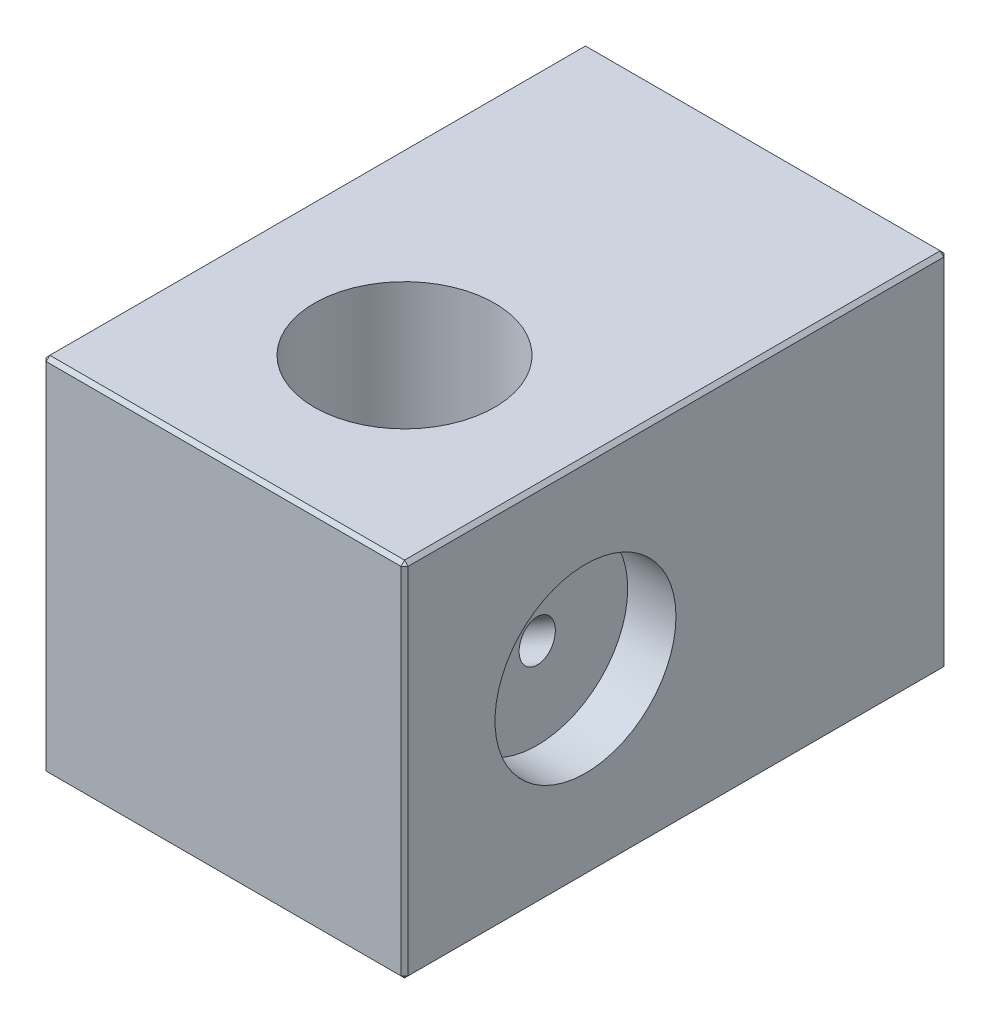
from build123d import *

# Parameters (mm, degrees)
SKICA1_W                      = 30
SKICA1_H                      = 45
P_IDAT_VYSUNUT_M1_DEPTH       = 30
ZKOSEN_1_SIZE                 = 0.3
SKICA2_R                      = 7.475
ODEBRAT_VYSUNUT_M1_DEPTH      = 12
SKICA3_R                      = 6.25
ODEBRAT_VYSUNUT_M2_DEPTH      = 3
F_3_5_3_5_PR_M_R_D_RY1_D      = 3.5
F_3_5_3_5_PR_M_R_D_RY1_DEPTH  = 10
F_3_5_3_5_PR_M_R_D_RY1_TIP    = 1.010362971
SKICA6_R                      = 7.5
ODEBRAT_VYSUNUT_M3_DEPTH      = 4
ODEBRAT_VYSUNUT_M4_DEPTH      = 12
ODEBRAT_VYSUNUT_M4_DEPTH_BACK = 4
SKICA8_R                      = 1.5
ODEBRAT_START                 = -4
SKICA9_R                      = 7.5
ODEBRAT_VYSUNUT_M5_DEPTH      = 4
F_3_0_3_PR_M_R_D_RY1_D        = 3
F_3_0_3_PR_M_R_D_RY1_DEPTH    = 7
F_3_0_3_PR_M_R_D_RY1_TIP      = 0.866025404
F_3_0_3_PR_M_R_D_RY2_D        = 3
F_3_0_3_PR_M_R_D_RY2_DEPTH    = 26
F_3_0_3_PR_M_R_D_RY2_TIP      = 0.866025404
G1_4_Z_VIT1_D                 = 11.8
G1_4_Z_VIT1_DEPTH             = 15
G1_4_Z_VIT1_TIP               = 3.406366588


with BuildPart() as part:
    # Skica1 → P_idat vysunut_m1 (new body)
    with BuildSketch(Plane(origin=(0, 0, 0), x_dir=(1, 0, 0), z_dir=(0, 1, 0))):
        with Locations((0, 22.5)):
            Rectangle(SKICA1_W, SKICA1_H)
    extrude(amount=P_IDAT_VYSUNUT_M1_DEPTH)

    # Zkosen_1
    zkosen_1_edges = [part.edges().sort_by_distance(p)[0] for p in [
        (15, 30, -22.5),
        (0, 30, -45),
        (-15, 30, -22.5),
        (0, 0, -45),
        (15, 0, -22.5),
        (0, 0, 0),
        (-15, 0, -22.5),
        (0, 30, 0),
        (-15, 15, -45),
        (15, 15, -45),
        (15, 15, 0),
        (-15, 15, 0),
    ]]
    chamfer(zkosen_1_edges, length=ZKOSEN_1_SIZE)

    # Skica2 → Odebrat vysunut_m1 (cut)
    with BuildSketch(Plane(origin=(0, 30, 0), x_dir=(1, 0, 0), z_dir=(0, 1, 0))):
        with Locations(Location((0, 15, 0), (0, 0, 270))):
            Circle(SKICA2_R)
    extrude(amount=-ODEBRAT_VYSUNUT_M1_DEPTH, mode=Mode.SUBTRACT)

    # Skica3 → Odebrat vysunut_m2 (cut)
    with BuildSketch(Plane(origin=(0, 18, 0), x_dir=(1, 0, 0), z_dir=(0, 1, 0))):
        with Locations(Location((0, 15, 0), (0, 0, 270))):
            Circle(SKICA3_R)
    extrude(amount=-ODEBRAT_VYSUNUT_M2_DEPTH, mode=Mode.SUBTRACT)

    # 3.5 _3.5_ pr_m_r d_ry1
    with Locations(Plane(origin=(0, 15, 0), x_dir=(-1, 0, 0), z_dir=(0, 1, 0))):
        with Locations((0, -15)):
            Hole(F_3_5_3_5_PR_M_R_D_RY1_D / 2, depth=F_3_5_3_5_PR_M_R_D_RY1_DEPTH)
            with Locations((0, 0, -(F_3_5_3_5_PR_M_R_D_RY1_DEPTH + F_3_5_3_5_PR_M_R_D_RY1_TIP / 2))):  # 120° drill point
                Cone(0, F_3_5_3_5_PR_M_R_D_RY1_D / 2, F_3_5_3_5_PR_M_R_D_RY1_TIP, mode=Mode.SUBTRACT)

    # Skica6 → Odebrat vysunut_m3 (cut)
    with BuildSketch(Plane(origin=(15, 0, 0), x_dir=(0, 0, -1), z_dir=(1, 0, 0))):
        with Locations((15, 15)):
            Circle(SKICA6_R)
    extrude(amount=-ODEBRAT_VYSUNUT_M3_DEPTH, mode=Mode.SUBTRACT)

    # Skica8 → Odebrat vysunut_m4 (cut, two sides: drawn at the far end of the back side and taken through both)
    with BuildSketch(Plane(origin=(13.965767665, 8.063139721, 0), x_dir=(0, 0, 1), z_dir=(-0.8660254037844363, -0.5000000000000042, 0)).offset(-ODEBRAT_VYSUNUT_M4_DEPTH_BACK)):
        with Locations(Location((-15, 7.490381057, 0), (0, 0, 270))):
            Circle(SKICA8_R)
    extrude(amount=ODEBRAT_VYSUNUT_M4_DEPTH + ODEBRAT_VYSUNUT_M4_DEPTH_BACK, mode=Mode.SUBTRACT)

    # Skica9 → Odebrat vysunut_m5 (cut)
    with BuildSketch(Plane.ZY.offset(15).offset(ODEBRAT_START)):
        with Locations(Location((-15, 15, 0), (0, 0, 180))):
            Circle(SKICA9_R)
    extrude(amount=ODEBRAT_VYSUNUT_M5_DEPTH, mode=Mode.SUBTRACT)

    # 3.0 _3_ pr_m_r d_ry1
    with Locations(Plane.ZY.offset(11)):
        with Locations((-15, 15)):
            Hole(F_3_0_3_PR_M_R_D_RY1_D / 2, depth=F_3_0_3_PR_M_R_D_RY1_DEPTH)
            with Locations((0, 0, -(F_3_0_3_PR_M_R_D_RY1_DEPTH + F_3_0_3_PR_M_R_D_RY1_TIP / 2))):  # 120° drill point
                Cone(0, F_3_0_3_PR_M_R_D_RY1_D / 2, F_3_0_3_PR_M_R_D_RY1_TIP, mode=Mode.SUBTRACT)

    # 3.0 _3_ pr_m_r d_ry2
    with Locations(Plane(origin=(0, 0, -45), x_dir=(-1, 0, 0), z_dir=(0, 0, -1))):
        with Locations((0, 15)):
            Hole(F_3_0_3_PR_M_R_D_RY2_D / 2, depth=F_3_0_3_PR_M_R_D_RY2_DEPTH)
            with Locations((0, 0, -(F_3_0_3_PR_M_R_D_RY2_DEPTH + F_3_0_3_PR_M_R_D_RY2_TIP / 2))):  # 120° drill point
                Cone(0, F_3_0_3_PR_M_R_D_RY2_D / 2, F_3_0_3_PR_M_R_D_RY2_TIP, mode=Mode.SUBTRACT)

    # G1_4 z_vit1
    with Locations(Plane(origin=(0, 0, -45), x_dir=(-1, 0, 0), z_dir=(0, 0, -1))):
        with Locations((0, 15)):
            Hole(G1_4_Z_VIT1_D / 2, depth=G1_4_Z_VIT1_DEPTH)
            with Locations((0, 0, -(G1_4_Z_VIT1_DEPTH + G1_4_Z_VIT1_TIP / 2))):  # 120° drill point
                Cone(0, G1_4_Z_VIT1_D / 2, G1_4_Z_VIT1_TIP, mode=Mode.SUBTRACT)


solid = part.part
